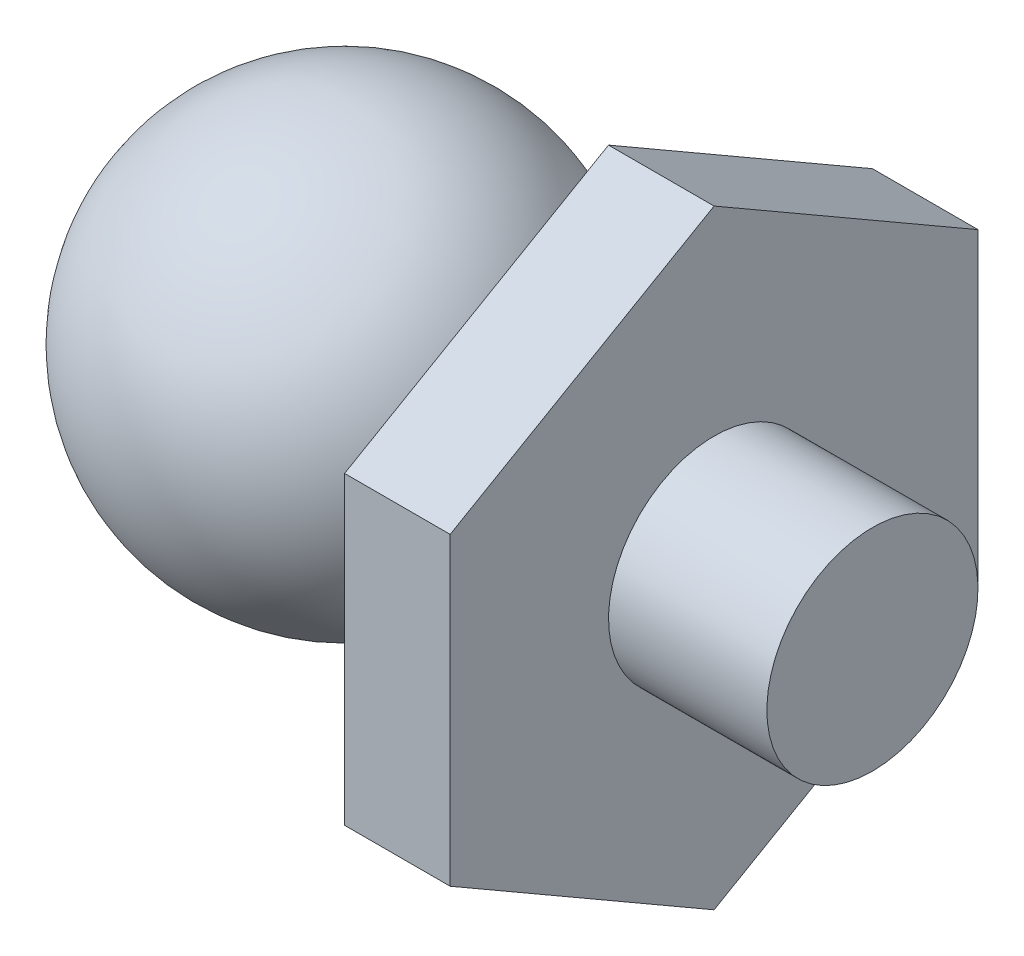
ISO-10303-21;
HEADER;
FILE_DESCRIPTION(('STEP AP214'),'2;1');
FILE_NAME('part.step','',(''),(''),'','','');
FILE_SCHEMA(('AUTOMOTIVE_DESIGN { 1 0 10303 214 1 1 1 1 }'));
ENDSEC;
DATA;
#1=APPLICATION_CONTEXT('core data for automotive mechanical design processes');
#2=APPLICATION_PROTOCOL_DEFINITION('international standard','automotive_design',2000,#1);
#3=PRODUCT_CONTEXT('',#1,'mechanical');
#4=PRODUCT('Part','Part','',(#3));
#5=PRODUCT_RELATED_PRODUCT_CATEGORY('part','',(#4));
#6=PRODUCT_DEFINITION_FORMATION('','',#4);
#7=PRODUCT_DEFINITION_CONTEXT('part definition',#1,'design');
#8=PRODUCT_DEFINITION('design','',#6,#7);
#9=PRODUCT_DEFINITION_SHAPE('','',#8);
#10=(LENGTH_UNIT() NAMED_UNIT(*) SI_UNIT(.MILLI.,.METRE.));
#11=(NAMED_UNIT(*) PLANE_ANGLE_UNIT() SI_UNIT($,.RADIAN.));
#12=(NAMED_UNIT(*) SI_UNIT($,.STERADIAN.) SOLID_ANGLE_UNIT());
#13=UNCERTAINTY_MEASURE_WITH_UNIT(LENGTH_MEASURE(1.E-05),#10,'distance_accuracy_value','');
#14=(GEOMETRIC_REPRESENTATION_CONTEXT(3) GLOBAL_UNCERTAINTY_ASSIGNED_CONTEXT((#13)) GLOBAL_UNIT_ASSIGNED_CONTEXT((#10,
#11,#12)) REPRESENTATION_CONTEXT('',''));
#15=CARTESIAN_POINT('',(0.,0.,0.));
#16=DIRECTION('',(0.,0.,1.));
#17=DIRECTION('',(1.,0.,0.));
#18=AXIS2_PLACEMENT_3D('',#15,#16,#17);
#19=CARTESIAN_POINT('',(0.,0.,0.));
#20=DIRECTION('',(-1.,0.,0.));
#21=DIRECTION('',(0.,-1.,0.));
#22=AXIS2_PLACEMENT_3D('',#19,#20,#21);
#23=CYLINDRICAL_SURFACE('',#22,1.);
#24=CARTESIAN_POINT('',(1.73205080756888,0.,0.));
#25=DIRECTION('',(-1.,0.,0.));
#26=DIRECTION('',(0.,-1.,0.));
#27=AXIS2_PLACEMENT_3D('',#24,#25,#26);
#28=CIRCLE('',#27,1.);
#29=CARTESIAN_POINT('',(1.73205080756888,-1.,0.));
#30=VERTEX_POINT('',#29);
#31=EDGE_CURVE('E456',#30,#30,#28,.T.);
#32=ORIENTED_EDGE('',*,*,#31,.F.);
#33=EDGE_LOOP('',(#32));
#34=FACE_BOUND('',#33,.T.);
#35=CARTESIAN_POINT('',(2.5,0.,0.));
#36=DIRECTION('',(1.,0.,0.));
#37=DIRECTION('',(0.,0.,-1.));
#38=AXIS2_PLACEMENT_3D('',#35,#36,#37);
#39=CIRCLE('',#38,1.);
#40=CARTESIAN_POINT('',(2.5,0.,-1.));
#41=VERTEX_POINT('',#40);
#42=EDGE_CURVE('E11',#41,#41,#39,.T.);
#43=ORIENTED_EDGE('',*,*,#42,.F.);
#44=EDGE_LOOP('',(#43));
#45=FACE_BOUND('',#44,.T.);
#46=ADVANCED_FACE('F350',(#34,#45),#23,.T.);
#47=CARTESIAN_POINT('',(0.,0.,0.));
#48=DIRECTION('',(-1.,0.,0.));
#49=DIRECTION('',(0.,1.,0.));
#50=AXIS2_PLACEMENT_3D('',#47,#48,#49);
#51=SPHERICAL_SURFACE('',#50,2.);
#52=ORIENTED_EDGE('',*,*,#31,.T.);
#53=EDGE_LOOP('',(#52));
#54=FACE_BOUND('',#53,.T.);
#55=ADVANCED_FACE('F474',(#54),#51,.T.);
#56=CARTESIAN_POINT('',(2.5,-4.33012701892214,-2.50000000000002));
#57=DIRECTION('',(1.,0.,0.));
#58=DIRECTION('',(0.,0.,-1.));
#59=AXIS2_PLACEMENT_3D('',#56,#57,#58);
#60=PLANE('',#59);
#61=DIRECTION('',(0.,-0.499999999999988,-0.866025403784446));
#62=VECTOR('',#61,1.);
#63=CARTESIAN_POINT('',(2.5,-1.44337567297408,2.50000000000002));
#64=LINE('',#63,#62);
#65=CARTESIAN_POINT('',(2.5,-1.44337567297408,2.50000000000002));
#66=VERTEX_POINT('',#65);
#67=CARTESIAN_POINT('',(2.5,-2.88675134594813,0.));
#68=VERTEX_POINT('',#67);
#69=EDGE_CURVE('E408',#66,#68,#64,.T.);
#70=ORIENTED_EDGE('',*,*,#69,.F.);
#71=DIRECTION('',(0.,-1.,0.));
#72=VECTOR('',#71,1.);
#73=CARTESIAN_POINT('',(2.5,1.44337567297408,2.50000000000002));
#74=LINE('',#73,#72);
#75=CARTESIAN_POINT('',(2.5,1.44337567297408,2.50000000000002));
#76=VERTEX_POINT('',#75);
#77=EDGE_CURVE('E413',#76,#66,#74,.T.);
#78=ORIENTED_EDGE('',*,*,#77,.F.);
#79=DIRECTION('',(0.,-0.5,0.866025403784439));
#80=VECTOR('',#79,1.);
#81=CARTESIAN_POINT('',(2.5,2.88675134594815,0.));
#82=LINE('',#81,#80);
#83=CARTESIAN_POINT('',(2.5,2.88675134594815,0.));
#84=VERTEX_POINT('',#83);
#85=EDGE_CURVE('E445',#84,#76,#82,.T.);
#86=ORIENTED_EDGE('',*,*,#85,.F.);
#87=DIRECTION('',(0.,0.5,0.866025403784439));
#88=VECTOR('',#87,1.);
#89=CARTESIAN_POINT('',(2.5,1.44337567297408,-2.50000000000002));
#90=LINE('',#89,#88);
#91=CARTESIAN_POINT('',(2.5,1.44337567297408,-2.50000000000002));
#92=VERTEX_POINT('',#91);
#93=EDGE_CURVE('E442',#92,#84,#90,.T.);
#94=ORIENTED_EDGE('',*,*,#93,.F.);
#95=DIRECTION('',(0.,1.,0.));
#96=VECTOR('',#95,1.);
#97=CARTESIAN_POINT('',(2.5,-1.44337567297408,-2.50000000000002));
#98=LINE('',#97,#96);
#99=CARTESIAN_POINT('',(2.5,-1.44337567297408,-2.50000000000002));
#100=VERTEX_POINT('',#99);
#101=EDGE_CURVE('E439',#100,#92,#98,.T.);
#102=ORIENTED_EDGE('',*,*,#101,.F.);
#103=DIRECTION('',(0.,0.5,-0.866025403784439));
#104=VECTOR('',#103,1.);
#105=CARTESIAN_POINT('',(2.5,-2.88675134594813,0.));
#106=LINE('',#105,#104);
#107=EDGE_CURVE('E437',#68,#100,#106,.T.);
#108=ORIENTED_EDGE('',*,*,#107,.F.);
#109=EDGE_LOOP('',(#70,#78,#86,#94,#102,#108));
#110=FACE_BOUND('',#109,.T.);
#111=ORIENTED_EDGE('',*,*,#42,.T.);
#112=EDGE_LOOP('',(#111));
#113=FACE_BOUND('',#112,.T.);
#114=ADVANCED_FACE('F466',(#110,#113),#60,.F.);
#115=CARTESIAN_POINT('',(3.5,-4.33012701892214,-2.50000000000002));
#116=DIRECTION('',(1.,0.,0.));
#117=DIRECTION('',(0.,0.,-1.));
#118=AXIS2_PLACEMENT_3D('',#115,#116,#117);
#119=PLANE('',#118);
#120=DIRECTION('',(0.,-0.499999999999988,-0.866025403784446));
#121=VECTOR('',#120,1.);
#122=CARTESIAN_POINT('',(3.5,-1.44337567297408,2.50000000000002));
#123=LINE('',#122,#121);
#124=CARTESIAN_POINT('',(3.5,-1.44337567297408,2.50000000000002));
#125=VERTEX_POINT('',#124);
#126=CARTESIAN_POINT('',(3.5,-2.88675134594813,0.));
#127=VERTEX_POINT('',#126);
#128=EDGE_CURVE('E406',#125,#127,#123,.T.);
#129=ORIENTED_EDGE('',*,*,#128,.T.);
#130=DIRECTION('',(0.,0.5,-0.866025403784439));
#131=VECTOR('',#130,1.);
#132=CARTESIAN_POINT('',(3.5,-2.88675134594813,0.));
#133=LINE('',#132,#131);
#134=CARTESIAN_POINT('',(3.5,-1.44337567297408,-2.50000000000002));
#135=VERTEX_POINT('',#134);
#136=EDGE_CURVE('E416',#127,#135,#133,.T.);
#137=ORIENTED_EDGE('',*,*,#136,.T.);
#138=DIRECTION('',(0.,1.,0.));
#139=VECTOR('',#138,1.);
#140=CARTESIAN_POINT('',(3.5,-1.44337567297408,-2.50000000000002));
#141=LINE('',#140,#139);
#142=CARTESIAN_POINT('',(3.5,1.44337567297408,-2.50000000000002));
#143=VERTEX_POINT('',#142);
#144=EDGE_CURVE('E421',#135,#143,#141,.T.);
#145=ORIENTED_EDGE('',*,*,#144,.T.);
#146=DIRECTION('',(0.,0.5,0.866025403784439));
#147=VECTOR('',#146,1.);
#148=CARTESIAN_POINT('',(3.5,1.44337567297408,-2.50000000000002));
#149=LINE('',#148,#147);
#150=CARTESIAN_POINT('',(3.5,2.88675134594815,0.));
#151=VERTEX_POINT('',#150);
#152=EDGE_CURVE('E430',#143,#151,#149,.T.);
#153=ORIENTED_EDGE('',*,*,#152,.T.);
#154=DIRECTION('',(0.,-0.5,0.866025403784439));
#155=VECTOR('',#154,1.);
#156=CARTESIAN_POINT('',(3.5,2.88675134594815,0.));
#157=LINE('',#156,#155);
#158=CARTESIAN_POINT('',(3.5,1.44337567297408,2.50000000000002));
#159=VERTEX_POINT('',#158);
#160=EDGE_CURVE('E433',#151,#159,#157,.T.);
#161=ORIENTED_EDGE('',*,*,#160,.T.);
#162=DIRECTION('',(0.,-1.,0.));
#163=VECTOR('',#162,1.);
#164=CARTESIAN_POINT('',(3.5,1.44337567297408,2.50000000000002));
#165=LINE('',#164,#163);
#166=EDGE_CURVE('E426',#159,#125,#165,.T.);
#167=ORIENTED_EDGE('',*,*,#166,.T.);
#168=EDGE_LOOP('',(#129,#137,#145,#153,#161,#167));
#169=FACE_BOUND('',#168,.T.);
#170=CARTESIAN_POINT('',(3.5,0.,0.));
#171=DIRECTION('',(1.,0.,0.));
#172=DIRECTION('',(0.,0.,-1.));
#173=AXIS2_PLACEMENT_3D('',#170,#171,#172);
#174=CIRCLE('',#173,1.);
#175=CARTESIAN_POINT('',(3.5,0.,-1.));
#176=VERTEX_POINT('',#175);
#177=EDGE_CURVE('E449',#176,#176,#174,.T.);
#178=ORIENTED_EDGE('',*,*,#177,.F.);
#179=EDGE_LOOP('',(#178));
#180=FACE_BOUND('',#179,.T.);
#181=ADVANCED_FACE('F423',(#169,#180),#119,.T.);
#182=CARTESIAN_POINT('',(2.5,-1.44337567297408,2.50000000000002));
#183=DIRECTION('',(0.,-0.866025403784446,0.499999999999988));
#184=DIRECTION('',(0.,-0.499999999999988,-0.866025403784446));
#185=AXIS2_PLACEMENT_3D('',#182,#183,#184);
#186=PLANE('',#185);
#187=ORIENTED_EDGE('',*,*,#128,.F.);
#188=DIRECTION('',(1.,0.,0.));
#189=VECTOR('',#188,1.);
#190=CARTESIAN_POINT('',(2.5,-1.44337567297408,2.50000000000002));
#191=LINE('',#190,#189);
#192=EDGE_CURVE('E365',#66,#125,#191,.T.);
#193=ORIENTED_EDGE('',*,*,#192,.F.);
#194=ORIENTED_EDGE('',*,*,#69,.T.);
#195=DIRECTION('',(1.,0.,0.));
#196=VECTOR('',#195,1.);
#197=CARTESIAN_POINT('',(2.5,-2.88675134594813,0.));
#198=LINE('',#197,#196);
#199=EDGE_CURVE('E402',#68,#127,#198,.T.);
#200=ORIENTED_EDGE('',*,*,#199,.T.);
#201=EDGE_LOOP('',(#187,#193,#194,#200));
#202=FACE_BOUND('',#201,.T.);
#203=ADVANCED_FACE('F404',(#202),#186,.T.);
#204=CARTESIAN_POINT('',(2.5,1.44337567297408,2.50000000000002));
#205=DIRECTION('',(0.,0.,1.));
#206=DIRECTION('',(1.,0.,0.));
#207=AXIS2_PLACEMENT_3D('',#204,#205,#206);
#208=PLANE('',#207);
#209=ORIENTED_EDGE('',*,*,#166,.F.);
#210=DIRECTION('',(1.,0.,0.));
#211=VECTOR('',#210,1.);
#212=CARTESIAN_POINT('',(2.5,1.44337567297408,2.50000000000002));
#213=LINE('',#212,#211);
#214=EDGE_CURVE('E373',#76,#159,#213,.T.);
#215=ORIENTED_EDGE('',*,*,#214,.F.);
#216=ORIENTED_EDGE('',*,*,#77,.T.);
#217=ORIENTED_EDGE('',*,*,#192,.T.);
#218=EDGE_LOOP('',(#209,#215,#216,#217));
#219=FACE_BOUND('',#218,.T.);
#220=ADVANCED_FACE('F472',(#219),#208,.T.);
#221=CARTESIAN_POINT('',(2.5,2.88675134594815,0.));
#222=DIRECTION('',(0.,0.866025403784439,0.5));
#223=DIRECTION('',(0.,-0.5,0.866025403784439));
#224=AXIS2_PLACEMENT_3D('',#221,#222,#223);
#225=PLANE('',#224);
#226=ORIENTED_EDGE('',*,*,#160,.F.);
#227=DIRECTION('',(1.,0.,0.));
#228=VECTOR('',#227,1.);
#229=CARTESIAN_POINT('',(2.5,2.88675134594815,0.));
#230=LINE('',#229,#228);
#231=EDGE_CURVE('E451',#84,#151,#230,.T.);
#232=ORIENTED_EDGE('',*,*,#231,.F.);
#233=ORIENTED_EDGE('',*,*,#85,.T.);
#234=ORIENTED_EDGE('',*,*,#214,.T.);
#235=EDGE_LOOP('',(#226,#232,#233,#234));
#236=FACE_BOUND('',#235,.T.);
#237=ADVANCED_FACE('F506',(#236),#225,.T.);
#238=CARTESIAN_POINT('',(2.5,1.44337567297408,-2.50000000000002));
#239=DIRECTION('',(0.,0.866025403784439,-0.5));
#240=DIRECTION('',(0.,0.5,0.866025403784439));
#241=AXIS2_PLACEMENT_3D('',#238,#239,#240);
#242=PLANE('',#241);
#243=ORIENTED_EDGE('',*,*,#152,.F.);
#244=DIRECTION('',(1.,0.,0.));
#245=VECTOR('',#244,1.);
#246=CARTESIAN_POINT('',(2.5,1.44337567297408,-2.50000000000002));
#247=LINE('',#246,#245);
#248=EDGE_CURVE('E453',#92,#143,#247,.T.);
#249=ORIENTED_EDGE('',*,*,#248,.F.);
#250=ORIENTED_EDGE('',*,*,#93,.T.);
#251=ORIENTED_EDGE('',*,*,#231,.T.);
#252=EDGE_LOOP('',(#243,#249,#250,#251));
#253=FACE_BOUND('',#252,.T.);
#254=ADVANCED_FACE('F500',(#253),#242,.T.);
#255=CARTESIAN_POINT('',(2.5,-1.44337567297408,-2.50000000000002));
#256=DIRECTION('',(0.,0.,-1.));
#257=DIRECTION('',(-1.,0.,0.));
#258=AXIS2_PLACEMENT_3D('',#255,#256,#257);
#259=PLANE('',#258);
#260=ORIENTED_EDGE('',*,*,#144,.F.);
#261=DIRECTION('',(1.,0.,0.));
#262=VECTOR('',#261,1.);
#263=CARTESIAN_POINT('',(2.5,-1.44337567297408,-2.50000000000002));
#264=LINE('',#263,#262);
#265=EDGE_CURVE('E412',#100,#135,#264,.T.);
#266=ORIENTED_EDGE('',*,*,#265,.F.);
#267=ORIENTED_EDGE('',*,*,#101,.T.);
#268=ORIENTED_EDGE('',*,*,#248,.T.);
#269=EDGE_LOOP('',(#260,#266,#267,#268));
#270=FACE_BOUND('',#269,.T.);
#271=ADVANCED_FACE('F494',(#270),#259,.T.);
#272=CARTESIAN_POINT('',(2.5,-2.88675134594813,0.));
#273=DIRECTION('',(0.,-0.866025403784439,-0.5));
#274=DIRECTION('',(0.,0.5,-0.866025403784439));
#275=AXIS2_PLACEMENT_3D('',#272,#273,#274);
#276=PLANE('',#275);
#277=ORIENTED_EDGE('',*,*,#136,.F.);
#278=ORIENTED_EDGE('',*,*,#199,.F.);
#279=ORIENTED_EDGE('',*,*,#107,.T.);
#280=ORIENTED_EDGE('',*,*,#265,.T.);
#281=EDGE_LOOP('',(#277,#278,#279,#280));
#282=FACE_BOUND('',#281,.T.);
#283=ADVANCED_FACE('F417',(#282),#276,.T.);
#284=CARTESIAN_POINT('',(5.,0.,0.));
#285=DIRECTION('',(-1.,0.,0.));
#286=DIRECTION('',(0.,-1.,0.));
#287=AXIS2_PLACEMENT_3D('',#284,#285,#286);
#288=PLANE('',#287);
#289=CARTESIAN_POINT('',(5.,0.,0.));
#290=DIRECTION('',(-1.,0.,0.));
#291=DIRECTION('',(0.,-1.,0.));
#292=AXIS2_PLACEMENT_3D('',#289,#290,#291);
#293=CIRCLE('',#292,1.);
#294=CARTESIAN_POINT('',(5.,-1.,0.));
#295=VERTEX_POINT('',#294);
#296=EDGE_CURVE('E358',#295,#295,#293,.T.);
#297=ORIENTED_EDGE('',*,*,#296,.F.);
#298=EDGE_LOOP('',(#297));
#299=FACE_BOUND('',#298,.T.);
#300=ADVANCED_FACE('F352',(#299),#288,.F.);
#301=ORIENTED_EDGE('',*,*,#177,.T.);
#302=EDGE_LOOP('',(#301));
#303=FACE_BOUND('',#302,.T.);
#304=ORIENTED_EDGE('',*,*,#296,.T.);
#305=EDGE_LOOP('',(#304));
#306=FACE_BOUND('',#305,.T.);
#307=ADVANCED_FACE('F463',(#303,#306),#23,.T.);
#308=CLOSED_SHELL('',(#46,#55,#114,#181,#203,#220,#237,#254,#271,#283,#300,#307));
#309=MANIFOLD_SOLID_BREP('B2',#308);
#310=ADVANCED_BREP_SHAPE_REPRESENTATION('',(#18,#309),#14);
#311=SHAPE_DEFINITION_REPRESENTATION(#9,#310);
ENDSEC;
END-ISO-10303-21;
